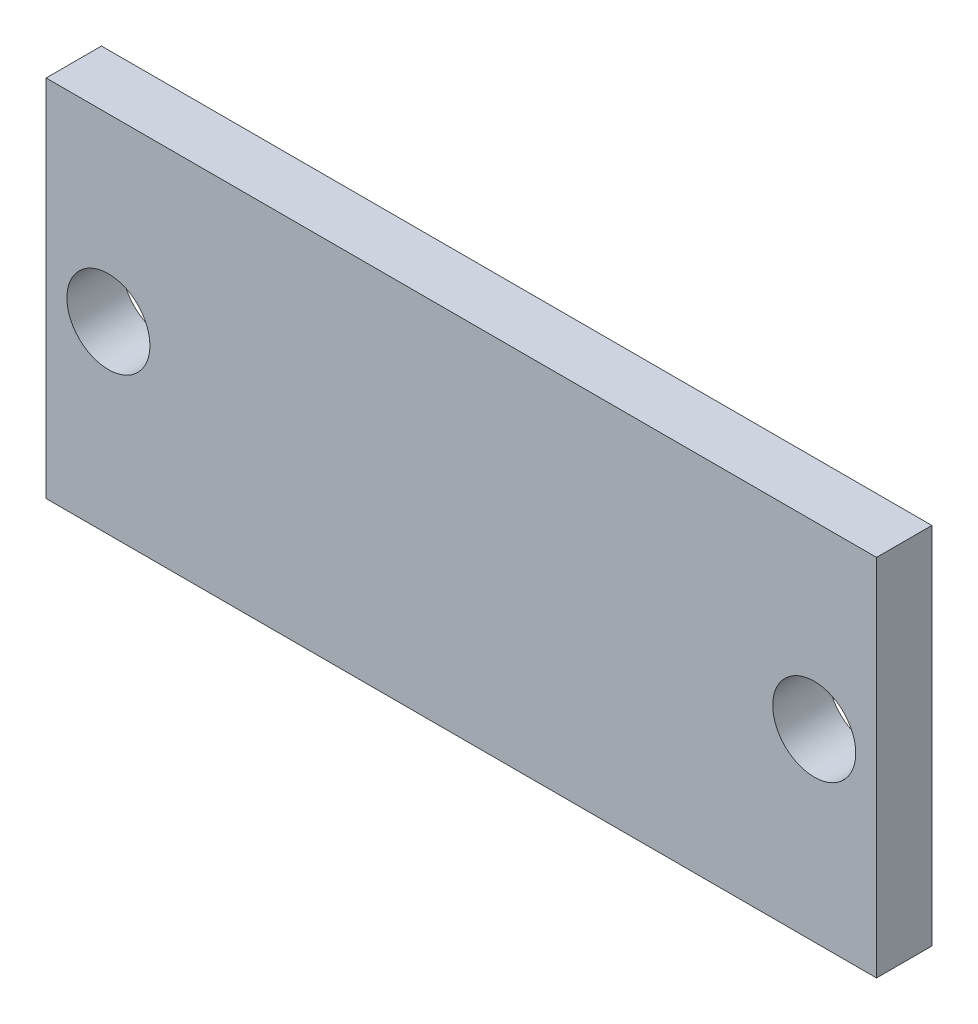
ISO-10303-21;
HEADER;
FILE_DESCRIPTION(('STEP AP214'),'2;1');
FILE_NAME('part.step','',(''),(''),'','','');
FILE_SCHEMA(('AUTOMOTIVE_DESIGN { 1 0 10303 214 1 1 1 1 }'));
ENDSEC;
DATA;
#1=APPLICATION_CONTEXT('core data for automotive mechanical design processes');
#2=APPLICATION_PROTOCOL_DEFINITION('international standard','automotive_design',2000,#1);
#3=PRODUCT_CONTEXT('',#1,'mechanical');
#4=PRODUCT('Part','Part','',(#3));
#5=PRODUCT_RELATED_PRODUCT_CATEGORY('part','',(#4));
#6=PRODUCT_DEFINITION_FORMATION('','',#4);
#7=PRODUCT_DEFINITION_CONTEXT('part definition',#1,'design');
#8=PRODUCT_DEFINITION('design','',#6,#7);
#9=PRODUCT_DEFINITION_SHAPE('','',#8);
#10=(LENGTH_UNIT() NAMED_UNIT(*) SI_UNIT(.MILLI.,.METRE.));
#11=(NAMED_UNIT(*) PLANE_ANGLE_UNIT() SI_UNIT($,.RADIAN.));
#12=(NAMED_UNIT(*) SI_UNIT($,.STERADIAN.) SOLID_ANGLE_UNIT());
#13=UNCERTAINTY_MEASURE_WITH_UNIT(LENGTH_MEASURE(1.E-05),#10,'distance_accuracy_value','');
#14=(GEOMETRIC_REPRESENTATION_CONTEXT(3) GLOBAL_UNCERTAINTY_ASSIGNED_CONTEXT((#13)) GLOBAL_UNIT_ASSIGNED_CONTEXT((#10,
#11,#12)) REPRESENTATION_CONTEXT('',''));
#15=CARTESIAN_POINT('',(0.,0.,0.));
#16=DIRECTION('',(0.,0.,1.));
#17=DIRECTION('',(1.,0.,0.));
#18=AXIS2_PLACEMENT_3D('',#15,#16,#17);
#19=CARTESIAN_POINT('',(0.,0.,2.));
#20=DIRECTION('',(0.,0.,1.));
#21=DIRECTION('',(1.,0.,0.));
#22=AXIS2_PLACEMENT_3D('',#19,#20,#21);
#23=PLANE('',#22);
#24=CARTESIAN_POINT('',(-12.75,0.0799999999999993,2.));
#25=DIRECTION('',(0.,0.,1.));
#26=DIRECTION('',(1.,0.,0.));
#27=AXIS2_PLACEMENT_3D('',#24,#25,#26);
#28=CIRCLE('',#27,1.5);
#29=CARTESIAN_POINT('',(-11.25,0.0799999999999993,2.));
#30=VERTEX_POINT('',#29);
#31=EDGE_CURVE('E103',#30,#30,#28,.T.);
#32=ORIENTED_EDGE('',*,*,#31,.F.);
#33=EDGE_LOOP('',(#32));
#34=FACE_BOUND('',#33,.T.);
#35=DIRECTION('',(0.,-1.,0.));
#36=VECTOR('',#35,1.);
#37=CARTESIAN_POINT('',(-15.,-6.58,2.));
#38=LINE('',#37,#36);
#39=CARTESIAN_POINT('',(-15.,6.58,2.));
#40=VERTEX_POINT('',#39);
#41=CARTESIAN_POINT('',(-15.,-6.58,2.));
#42=VERTEX_POINT('',#41);
#43=EDGE_CURVE('E88',#40,#42,#38,.T.);
#44=ORIENTED_EDGE('',*,*,#43,.T.);
#45=DIRECTION('',(1.,0.,0.));
#46=VECTOR('',#45,1.);
#47=CARTESIAN_POINT('',(15.,-6.58,2.));
#48=LINE('',#47,#46);
#49=CARTESIAN_POINT('',(15.,-6.58,2.));
#50=VERTEX_POINT('',#49);
#51=EDGE_CURVE('E83',#42,#50,#48,.T.);
#52=ORIENTED_EDGE('',*,*,#51,.T.);
#53=DIRECTION('',(0.,1.,0.));
#54=VECTOR('',#53,1.);
#55=CARTESIAN_POINT('',(15.,-6.58,2.));
#56=LINE('',#55,#54);
#57=CARTESIAN_POINT('',(15.,6.58,2.));
#58=VERTEX_POINT('',#57);
#59=EDGE_CURVE('E86',#50,#58,#56,.T.);
#60=ORIENTED_EDGE('',*,*,#59,.T.);
#61=DIRECTION('',(-1.,0.,0.));
#62=VECTOR('',#61,1.);
#63=CARTESIAN_POINT('',(15.,6.58,2.));
#64=LINE('',#63,#62);
#65=EDGE_CURVE('E53',#58,#40,#64,.T.);
#66=ORIENTED_EDGE('',*,*,#65,.T.);
#67=EDGE_LOOP('',(#44,#52,#60,#66));
#68=FACE_BOUND('',#67,.T.);
#69=CARTESIAN_POINT('',(12.75,0.0800000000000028,2.));
#70=DIRECTION('',(0.,0.,1.));
#71=DIRECTION('',(1.,0.,0.));
#72=AXIS2_PLACEMENT_3D('',#69,#70,#71);
#73=CIRCLE('',#72,1.5);
#74=CARTESIAN_POINT('',(14.25,0.0800000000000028,2.));
#75=VERTEX_POINT('',#74);
#76=EDGE_CURVE('E118',#75,#75,#73,.T.);
#77=ORIENTED_EDGE('',*,*,#76,.F.);
#78=EDGE_LOOP('',(#77));
#79=FACE_BOUND('',#78,.T.);
#80=ADVANCED_FACE('F36',(#34,#68,#79),#23,.T.);
#81=CARTESIAN_POINT('',(0.,0.,0.));
#82=DIRECTION('',(0.,0.,1.));
#83=DIRECTION('',(1.,0.,0.));
#84=AXIS2_PLACEMENT_3D('',#81,#82,#83);
#85=PLANE('',#84);
#86=DIRECTION('',(0.,-1.,0.));
#87=VECTOR('',#86,1.);
#88=CARTESIAN_POINT('',(-15.,-6.58,0.));
#89=LINE('',#88,#87);
#90=CARTESIAN_POINT('',(-15.,6.58,0.));
#91=VERTEX_POINT('',#90);
#92=CARTESIAN_POINT('',(-15.,-6.58,0.));
#93=VERTEX_POINT('',#92);
#94=EDGE_CURVE('E100',#91,#93,#89,.T.);
#95=ORIENTED_EDGE('',*,*,#94,.F.);
#96=DIRECTION('',(-1.,0.,0.));
#97=VECTOR('',#96,1.);
#98=CARTESIAN_POINT('',(15.,6.58,0.));
#99=LINE('',#98,#97);
#100=CARTESIAN_POINT('',(15.,6.58,0.));
#101=VERTEX_POINT('',#100);
#102=EDGE_CURVE('E76',#101,#91,#99,.T.);
#103=ORIENTED_EDGE('',*,*,#102,.F.);
#104=DIRECTION('',(0.,1.,0.));
#105=VECTOR('',#104,1.);
#106=CARTESIAN_POINT('',(15.,-6.58,0.));
#107=LINE('',#106,#105);
#108=CARTESIAN_POINT('',(15.,-6.58,0.));
#109=VERTEX_POINT('',#108);
#110=EDGE_CURVE('E70',#109,#101,#107,.T.);
#111=ORIENTED_EDGE('',*,*,#110,.F.);
#112=DIRECTION('',(1.,0.,0.));
#113=VECTOR('',#112,1.);
#114=CARTESIAN_POINT('',(15.,-6.58,0.));
#115=LINE('',#114,#113);
#116=EDGE_CURVE('E92',#93,#109,#115,.T.);
#117=ORIENTED_EDGE('',*,*,#116,.F.);
#118=EDGE_LOOP('',(#95,#103,#111,#117));
#119=FACE_BOUND('',#118,.T.);
#120=CARTESIAN_POINT('',(-12.75,0.0799999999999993,0.));
#121=DIRECTION('',(0.,0.,1.));
#122=DIRECTION('',(1.,0.,0.));
#123=AXIS2_PLACEMENT_3D('',#120,#121,#122);
#124=CIRCLE('',#123,1.5);
#125=CARTESIAN_POINT('',(-11.25,0.0799999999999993,0.));
#126=VERTEX_POINT('',#125);
#127=EDGE_CURVE('E115',#126,#126,#124,.T.);
#128=ORIENTED_EDGE('',*,*,#127,.T.);
#129=EDGE_LOOP('',(#128));
#130=FACE_BOUND('',#129,.T.);
#131=CARTESIAN_POINT('',(12.75,0.0800000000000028,0.));
#132=DIRECTION('',(0.,0.,1.));
#133=DIRECTION('',(1.,0.,0.));
#134=AXIS2_PLACEMENT_3D('',#131,#132,#133);
#135=CIRCLE('',#134,1.5);
#136=CARTESIAN_POINT('',(14.25,0.0800000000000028,0.));
#137=VERTEX_POINT('',#136);
#138=EDGE_CURVE('E121',#137,#137,#135,.T.);
#139=ORIENTED_EDGE('',*,*,#138,.T.);
#140=EDGE_LOOP('',(#139));
#141=FACE_BOUND('',#140,.T.);
#142=ADVANCED_FACE('F111',(#119,#130,#141),#85,.F.);
#143=CARTESIAN_POINT('',(-15.,-6.58,2.));
#144=DIRECTION('',(1.,0.,0.));
#145=DIRECTION('',(0.,0.,-1.));
#146=AXIS2_PLACEMENT_3D('',#143,#144,#145);
#147=PLANE('',#146);
#148=ORIENTED_EDGE('',*,*,#94,.T.);
#149=DIRECTION('',(0.,0.,-1.));
#150=VECTOR('',#149,1.);
#151=CARTESIAN_POINT('',(-15.,-6.58,2.));
#152=LINE('',#151,#150);
#153=EDGE_CURVE('E11',#42,#93,#152,.T.);
#154=ORIENTED_EDGE('',*,*,#153,.F.);
#155=ORIENTED_EDGE('',*,*,#43,.F.);
#156=DIRECTION('',(0.,0.,-1.));
#157=VECTOR('',#156,1.);
#158=CARTESIAN_POINT('',(-15.,6.58,2.));
#159=LINE('',#158,#157);
#160=EDGE_CURVE('E96',#40,#91,#159,.T.);
#161=ORIENTED_EDGE('',*,*,#160,.T.);
#162=EDGE_LOOP('',(#148,#154,#155,#161));
#163=FACE_BOUND('',#162,.T.);
#164=ADVANCED_FACE('F38',(#163),#147,.F.);
#165=CARTESIAN_POINT('',(15.,-6.58,2.));
#166=DIRECTION('',(0.,1.,0.));
#167=DIRECTION('',(-1.,0.,0.));
#168=AXIS2_PLACEMENT_3D('',#165,#166,#167);
#169=PLANE('',#168);
#170=ORIENTED_EDGE('',*,*,#116,.T.);
#171=DIRECTION('',(0.,0.,-1.));
#172=VECTOR('',#171,1.);
#173=CARTESIAN_POINT('',(15.,-6.58,2.));
#174=LINE('',#173,#172);
#175=EDGE_CURVE('E45',#50,#109,#174,.T.);
#176=ORIENTED_EDGE('',*,*,#175,.F.);
#177=ORIENTED_EDGE('',*,*,#51,.F.);
#178=ORIENTED_EDGE('',*,*,#153,.T.);
#179=EDGE_LOOP('',(#170,#176,#177,#178));
#180=FACE_BOUND('',#179,.T.);
#181=ADVANCED_FACE('F91',(#180),#169,.F.);
#182=CARTESIAN_POINT('',(15.,-6.58,2.));
#183=DIRECTION('',(-1.,0.,0.));
#184=DIRECTION('',(0.,0.,1.));
#185=AXIS2_PLACEMENT_3D('',#182,#183,#184);
#186=PLANE('',#185);
#187=ORIENTED_EDGE('',*,*,#110,.T.);
#188=DIRECTION('',(0.,0.,-1.));
#189=VECTOR('',#188,1.);
#190=CARTESIAN_POINT('',(15.,6.58,2.));
#191=LINE('',#190,#189);
#192=EDGE_CURVE('E93',#58,#101,#191,.T.);
#193=ORIENTED_EDGE('',*,*,#192,.F.);
#194=ORIENTED_EDGE('',*,*,#59,.F.);
#195=ORIENTED_EDGE('',*,*,#175,.T.);
#196=EDGE_LOOP('',(#187,#193,#194,#195));
#197=FACE_BOUND('',#196,.T.);
#198=ADVANCED_FACE('F94',(#197),#186,.F.);
#199=CARTESIAN_POINT('',(15.,6.58,2.));
#200=DIRECTION('',(0.,-1.,0.));
#201=DIRECTION('',(1.,0.,0.));
#202=AXIS2_PLACEMENT_3D('',#199,#200,#201);
#203=PLANE('',#202);
#204=ORIENTED_EDGE('',*,*,#102,.T.);
#205=ORIENTED_EDGE('',*,*,#160,.F.);
#206=ORIENTED_EDGE('',*,*,#65,.F.);
#207=ORIENTED_EDGE('',*,*,#192,.T.);
#208=EDGE_LOOP('',(#204,#205,#206,#207));
#209=FACE_BOUND('',#208,.T.);
#210=ADVANCED_FACE('F108',(#209),#203,.F.);
#211=CARTESIAN_POINT('',(-12.75,0.0799999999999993,2.));
#212=DIRECTION('',(0.,0.,-1.));
#213=DIRECTION('',(-1.,0.,0.));
#214=AXIS2_PLACEMENT_3D('',#211,#212,#213);
#215=CYLINDRICAL_SURFACE('',#214,1.5);
#216=ORIENTED_EDGE('',*,*,#31,.T.);
#217=EDGE_LOOP('',(#216));
#218=FACE_BOUND('',#217,.T.);
#219=ORIENTED_EDGE('',*,*,#127,.F.);
#220=EDGE_LOOP('',(#219));
#221=FACE_BOUND('',#220,.T.);
#222=ADVANCED_FACE('F138',(#218,#221),#215,.F.);
#223=CARTESIAN_POINT('',(12.75,0.0800000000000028,2.));
#224=DIRECTION('',(0.,0.,-1.));
#225=DIRECTION('',(-1.,0.,0.));
#226=AXIS2_PLACEMENT_3D('',#223,#224,#225);
#227=CYLINDRICAL_SURFACE('',#226,1.5);
#228=ORIENTED_EDGE('',*,*,#76,.T.);
#229=EDGE_LOOP('',(#228));
#230=FACE_BOUND('',#229,.T.);
#231=ORIENTED_EDGE('',*,*,#138,.F.);
#232=EDGE_LOOP('',(#231));
#233=FACE_BOUND('',#232,.T.);
#234=ADVANCED_FACE('F127',(#230,#233),#227,.F.);
#235=CLOSED_SHELL('',(#80,#142,#164,#181,#198,#210,#222,#234));
#236=MANIFOLD_SOLID_BREP('B2',#235);
#237=ADVANCED_BREP_SHAPE_REPRESENTATION('',(#18,#236),#14);
#238=SHAPE_DEFINITION_REPRESENTATION(#9,#237);
ENDSEC;
END-ISO-10303-21;
